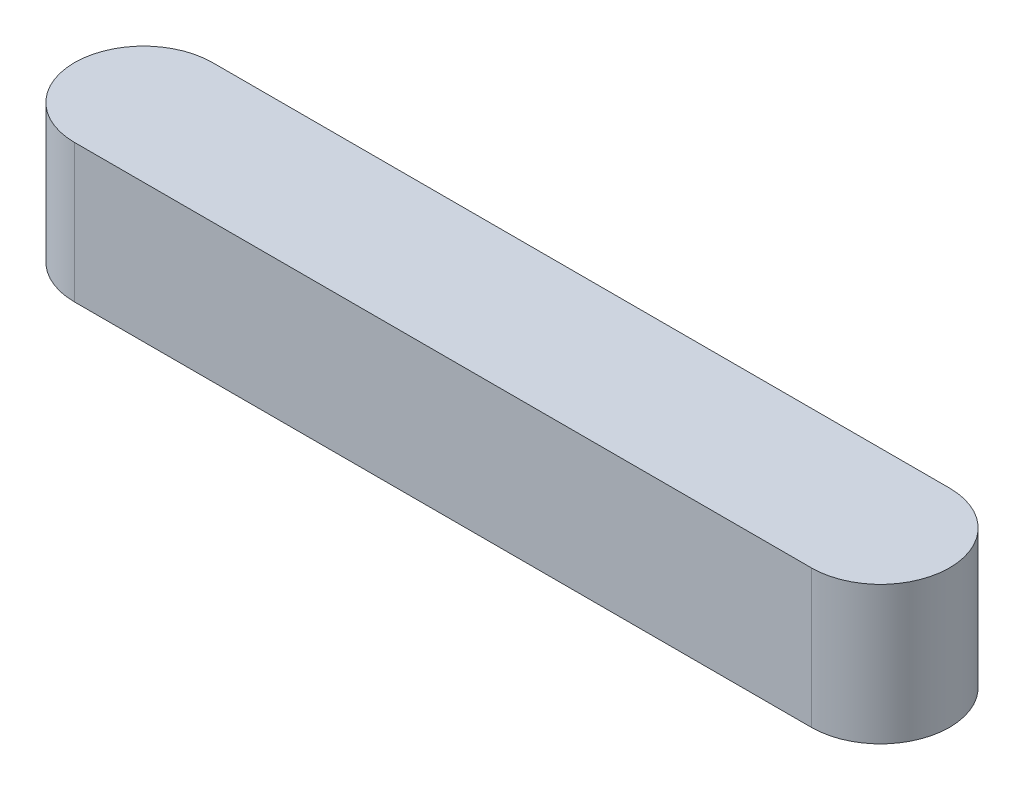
ISO-10303-21;
HEADER;
FILE_DESCRIPTION(('STEP AP214'),'2;1');
FILE_NAME('part.step','',(''),(''),'','','');
FILE_SCHEMA(('AUTOMOTIVE_DESIGN { 1 0 10303 214 1 1 1 1 }'));
ENDSEC;
DATA;
#1=APPLICATION_CONTEXT('core data for automotive mechanical design processes');
#2=APPLICATION_PROTOCOL_DEFINITION('international standard','automotive_design',2000,#1);
#3=PRODUCT_CONTEXT('',#1,'mechanical');
#4=PRODUCT('Part','Part','',(#3));
#5=PRODUCT_RELATED_PRODUCT_CATEGORY('part','',(#4));
#6=PRODUCT_DEFINITION_FORMATION('','',#4);
#7=PRODUCT_DEFINITION_CONTEXT('part definition',#1,'design');
#8=PRODUCT_DEFINITION('design','',#6,#7);
#9=PRODUCT_DEFINITION_SHAPE('','',#8);
#10=(LENGTH_UNIT() NAMED_UNIT(*) SI_UNIT(.MILLI.,.METRE.));
#11=(NAMED_UNIT(*) PLANE_ANGLE_UNIT() SI_UNIT($,.RADIAN.));
#12=(NAMED_UNIT(*) SI_UNIT($,.STERADIAN.) SOLID_ANGLE_UNIT());
#13=UNCERTAINTY_MEASURE_WITH_UNIT(LENGTH_MEASURE(1.E-05),#10,'distance_accuracy_value','');
#14=(GEOMETRIC_REPRESENTATION_CONTEXT(3) GLOBAL_UNCERTAINTY_ASSIGNED_CONTEXT((#13)) GLOBAL_UNIT_ASSIGNED_CONTEXT((#10,
#11,#12)) REPRESENTATION_CONTEXT('',''));
#15=CARTESIAN_POINT('',(0.,0.,0.));
#16=DIRECTION('',(0.,0.,1.));
#17=DIRECTION('',(1.,0.,0.));
#18=AXIS2_PLACEMENT_3D('',#15,#16,#17);
#19=CARTESIAN_POINT('',(0.,6.,0.));
#20=DIRECTION('',(0.,-1.,0.));
#21=DIRECTION('',(0.,0.,-1.));
#22=AXIS2_PLACEMENT_3D('',#19,#20,#21);
#23=CYLINDRICAL_SURFACE('',#22,3.);
#24=CARTESIAN_POINT('',(0.,0.,0.));
#25=DIRECTION('',(0.,1.,0.));
#26=DIRECTION('',(0.,0.,1.));
#27=AXIS2_PLACEMENT_3D('',#24,#25,#26);
#28=CIRCLE('',#27,3.);
#29=CARTESIAN_POINT('',(0.,0.,-3.));
#30=VERTEX_POINT('',#29);
#31=CARTESIAN_POINT('',(0.,0.,3.));
#32=VERTEX_POINT('',#31);
#33=EDGE_CURVE('E91',#30,#32,#28,.T.);
#34=ORIENTED_EDGE('',*,*,#33,.T.);
#35=DIRECTION('',(0.,-1.,0.));
#36=VECTOR('',#35,1.);
#37=CARTESIAN_POINT('',(0.,6.,3.));
#38=LINE('',#37,#36);
#39=CARTESIAN_POINT('',(0.,6.,3.));
#40=VERTEX_POINT('',#39);
#41=EDGE_CURVE('E13',#40,#32,#38,.T.);
#42=ORIENTED_EDGE('',*,*,#41,.F.);
#43=CARTESIAN_POINT('',(0.,6.,0.));
#44=DIRECTION('',(0.,1.,0.));
#45=DIRECTION('',(0.,0.,1.));
#46=AXIS2_PLACEMENT_3D('',#43,#44,#45);
#47=CIRCLE('',#46,3.);
#48=CARTESIAN_POINT('',(0.,6.,-3.));
#49=VERTEX_POINT('',#48);
#50=EDGE_CURVE('E109',#49,#40,#47,.T.);
#51=ORIENTED_EDGE('',*,*,#50,.F.);
#52=DIRECTION('',(0.,-1.,0.));
#53=VECTOR('',#52,1.);
#54=CARTESIAN_POINT('',(0.,6.,-3.));
#55=LINE('',#54,#53);
#56=EDGE_CURVE('E103',#49,#30,#55,.T.);
#57=ORIENTED_EDGE('',*,*,#56,.T.);
#58=EDGE_LOOP('',(#34,#42,#51,#57));
#59=FACE_BOUND('',#58,.T.);
#60=ADVANCED_FACE('F47',(#59),#23,.T.);
#61=CARTESIAN_POINT('',(0.,6.,3.));
#62=DIRECTION('',(0.,0.,-1.));
#63=DIRECTION('',(-1.,0.,0.));
#64=AXIS2_PLACEMENT_3D('',#61,#62,#63);
#65=PLANE('',#64);
#66=DIRECTION('',(1.,0.,0.));
#67=VECTOR('',#66,1.);
#68=CARTESIAN_POINT('',(0.,0.,3.));
#69=LINE('',#68,#67);
#70=CARTESIAN_POINT('',(32.,0.,3.));
#71=VERTEX_POINT('',#70);
#72=EDGE_CURVE('E87',#32,#71,#69,.T.);
#73=ORIENTED_EDGE('',*,*,#72,.T.);
#74=DIRECTION('',(0.,-1.,0.));
#75=VECTOR('',#74,1.);
#76=CARTESIAN_POINT('',(32.,6.,3.));
#77=LINE('',#76,#75);
#78=CARTESIAN_POINT('',(32.,6.,3.));
#79=VERTEX_POINT('',#78);
#80=EDGE_CURVE('E54',#79,#71,#77,.T.);
#81=ORIENTED_EDGE('',*,*,#80,.F.);
#82=DIRECTION('',(1.,0.,0.));
#83=VECTOR('',#82,1.);
#84=CARTESIAN_POINT('',(0.,6.,3.));
#85=LINE('',#84,#83);
#86=EDGE_CURVE('E99',#40,#79,#85,.T.);
#87=ORIENTED_EDGE('',*,*,#86,.F.);
#88=ORIENTED_EDGE('',*,*,#41,.T.);
#89=EDGE_LOOP('',(#73,#81,#87,#88));
#90=FACE_BOUND('',#89,.T.);
#91=ADVANCED_FACE('F98',(#90),#65,.F.);
#92=CARTESIAN_POINT('',(32.,6.,0.));
#93=DIRECTION('',(0.,-1.,0.));
#94=DIRECTION('',(0.,0.,-1.));
#95=AXIS2_PLACEMENT_3D('',#92,#93,#94);
#96=CYLINDRICAL_SURFACE('',#95,3.);
#97=CARTESIAN_POINT('',(32.,0.,0.));
#98=DIRECTION('',(0.,1.,0.));
#99=DIRECTION('',(0.,0.,1.));
#100=AXIS2_PLACEMENT_3D('',#97,#98,#99);
#101=CIRCLE('',#100,3.);
#102=CARTESIAN_POINT('',(32.,0.,-3.));
#103=VERTEX_POINT('',#102);
#104=EDGE_CURVE('E92',#71,#103,#101,.T.);
#105=ORIENTED_EDGE('',*,*,#104,.T.);
#106=DIRECTION('',(0.,-1.,0.));
#107=VECTOR('',#106,1.);
#108=CARTESIAN_POINT('',(32.,6.,-3.));
#109=LINE('',#108,#107);
#110=CARTESIAN_POINT('',(32.,6.,-3.));
#111=VERTEX_POINT('',#110);
#112=EDGE_CURVE('E115',#111,#103,#109,.T.);
#113=ORIENTED_EDGE('',*,*,#112,.F.);
#114=CARTESIAN_POINT('',(32.,6.,0.));
#115=DIRECTION('',(0.,1.,0.));
#116=DIRECTION('',(0.,0.,1.));
#117=AXIS2_PLACEMENT_3D('',#114,#115,#116);
#118=CIRCLE('',#117,3.);
#119=EDGE_CURVE('E66',#79,#111,#118,.T.);
#120=ORIENTED_EDGE('',*,*,#119,.F.);
#121=ORIENTED_EDGE('',*,*,#80,.T.);
#122=EDGE_LOOP('',(#105,#113,#120,#121));
#123=FACE_BOUND('',#122,.T.);
#124=ADVANCED_FACE('F118',(#123),#96,.T.);
#125=CARTESIAN_POINT('',(0.,6.,-3.));
#126=DIRECTION('',(0.,0.,1.));
#127=DIRECTION('',(1.,0.,0.));
#128=AXIS2_PLACEMENT_3D('',#125,#126,#127);
#129=PLANE('',#128);
#130=DIRECTION('',(-1.,0.,0.));
#131=VECTOR('',#130,1.);
#132=CARTESIAN_POINT('',(0.,0.,-3.));
#133=LINE('',#132,#131);
#134=EDGE_CURVE('E107',#103,#30,#133,.T.);
#135=ORIENTED_EDGE('',*,*,#134,.T.);
#136=ORIENTED_EDGE('',*,*,#56,.F.);
#137=DIRECTION('',(-1.,0.,0.));
#138=VECTOR('',#137,1.);
#139=CARTESIAN_POINT('',(0.,6.,-3.));
#140=LINE('',#139,#138);
#141=EDGE_CURVE('E61',#111,#49,#140,.T.);
#142=ORIENTED_EDGE('',*,*,#141,.F.);
#143=ORIENTED_EDGE('',*,*,#112,.T.);
#144=EDGE_LOOP('',(#135,#136,#142,#143));
#145=FACE_BOUND('',#144,.T.);
#146=ADVANCED_FACE('F120',(#145),#129,.F.);
#147=CARTESIAN_POINT('',(0.,6.,0.));
#148=DIRECTION('',(0.,1.,0.));
#149=DIRECTION('',(0.,0.,1.));
#150=AXIS2_PLACEMENT_3D('',#147,#148,#149);
#151=PLANE('',#150);
#152=ORIENTED_EDGE('',*,*,#50,.T.);
#153=ORIENTED_EDGE('',*,*,#86,.T.);
#154=ORIENTED_EDGE('',*,*,#119,.T.);
#155=ORIENTED_EDGE('',*,*,#141,.T.);
#156=EDGE_LOOP('',(#152,#153,#154,#155));
#157=FACE_BOUND('',#156,.T.);
#158=ADVANCED_FACE('F121',(#157),#151,.T.);
#159=CARTESIAN_POINT('',(0.,0.,0.));
#160=DIRECTION('',(0.,1.,0.));
#161=DIRECTION('',(0.,0.,1.));
#162=AXIS2_PLACEMENT_3D('',#159,#160,#161);
#163=PLANE('',#162);
#164=ORIENTED_EDGE('',*,*,#33,.F.);
#165=ORIENTED_EDGE('',*,*,#134,.F.);
#166=ORIENTED_EDGE('',*,*,#104,.F.);
#167=ORIENTED_EDGE('',*,*,#72,.F.);
#168=EDGE_LOOP('',(#164,#165,#166,#167));
#169=FACE_BOUND('',#168,.T.);
#170=ADVANCED_FACE('F88',(#169),#163,.F.);
#171=CLOSED_SHELL('',(#60,#91,#124,#146,#158,#170));
#172=MANIFOLD_SOLID_BREP('B2',#171);
#173=ADVANCED_BREP_SHAPE_REPRESENTATION('',(#18,#172),#14);
#174=SHAPE_DEFINITION_REPRESENTATION(#9,#173);
ENDSEC;
END-ISO-10303-21;
